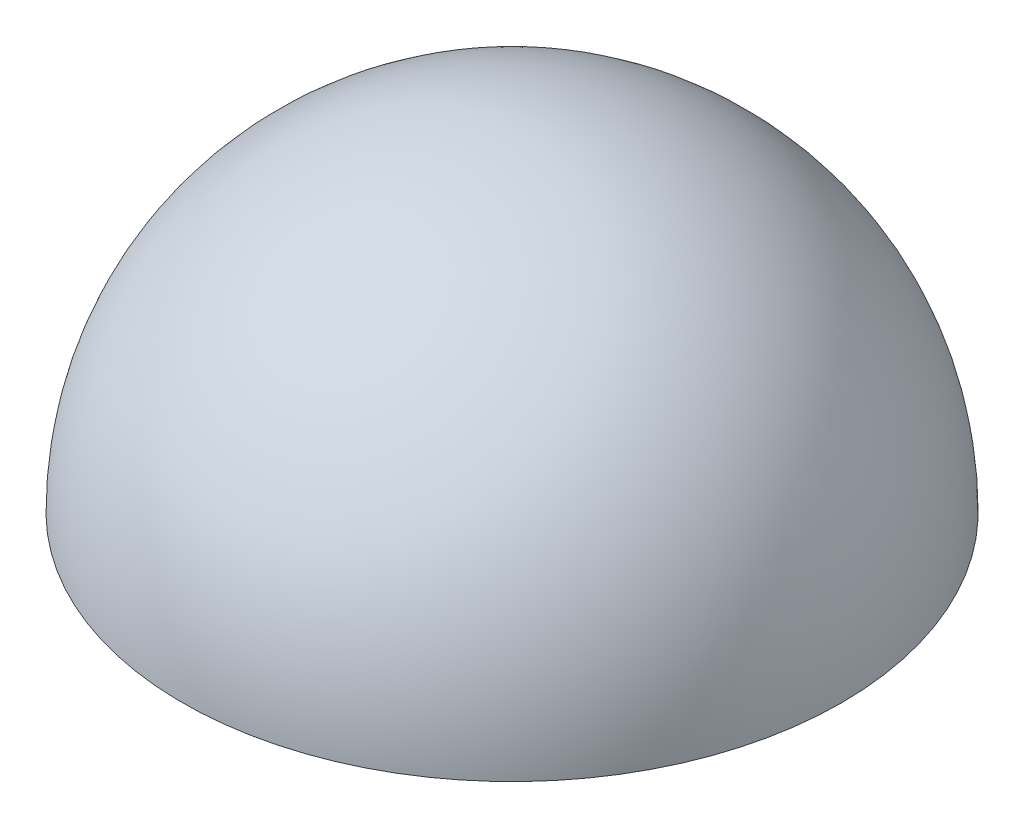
from build123d import *

# Parameters (mm, degrees)
REVOLVE_THIN1_ANGLE = 180


with BuildPart() as part:
    # Sketch1 → Revolve-Thin1 (revolve)
    with BuildSketch(Plane(origin=(0, 0, 0), x_dir=(1, 0, 0), z_dir=(0, 1, 0))):
        with BuildLine():
            ThreePointArc((-21.665053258, 0), (0.084946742, 21.75), (21.834946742, 0))
            Line((21.834946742, 0), (23.334946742, 0))
            ThreePointArc((23.334946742, 0), (0.084946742, 23.25), (-23.165053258, 0))
            Line((-23.165053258, 0), (-21.665053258, 0))
        make_face()
    revolve(axis=Axis((-26.788231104, 0, 0), (1, 0, 0)), revolution_arc=REVOLVE_THIN1_ANGLE)


solid = part.part
